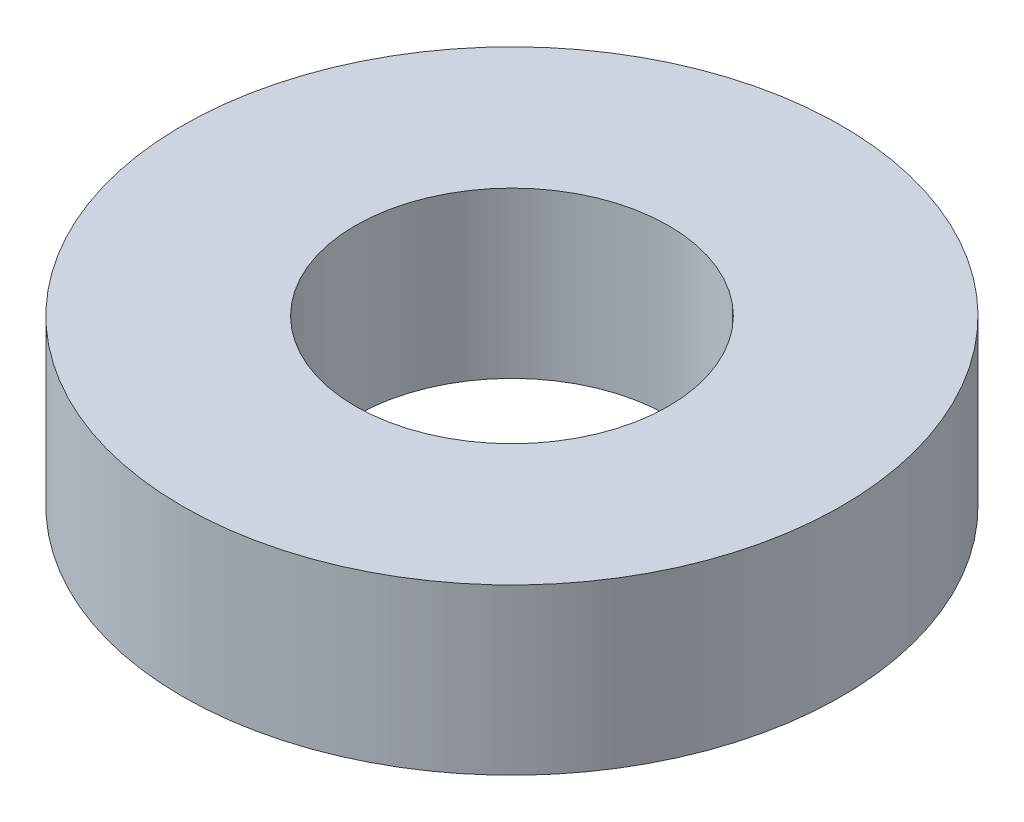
from build123d import *

# Parameters (mm, degrees)
SKIZZE1_R                       = 2
SKIZZE1_R_2                     = 0.95
AUFSATZ_LINEAR_AUSTRAGEN1_DEPTH = 0.5


with BuildPart() as part:
    # Skizze1 → Aufsatz-Linear austragen1 (new, symmetric)
    with BuildSketch(Plane(origin=(0, 0, 0), x_dir=(1, 0, 0), z_dir=(0, 1, 0))):
        with Locations(Location((0, 0, 0), (0, 0, 270))):
            Circle(SKIZZE1_R)
        with Locations(Location((0, 0, 0), (0, 0, 270))):
            Circle(SKIZZE1_R_2, mode=Mode.SUBTRACT)
    extrude(amount=AUFSATZ_LINEAR_AUSTRAGEN1_DEPTH, both=True)


solid = part.part
